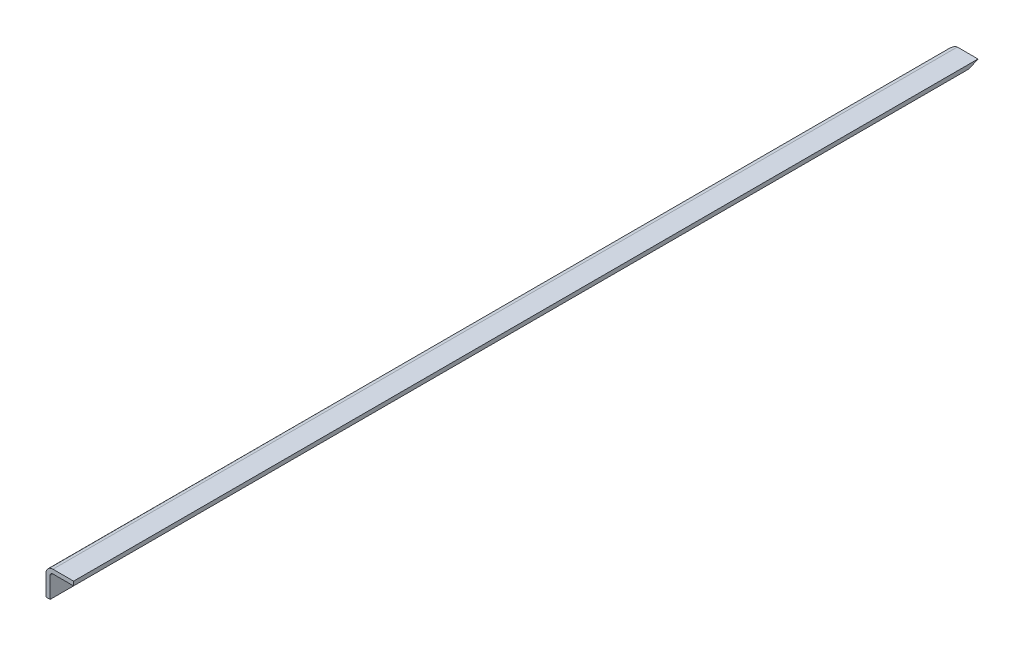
from build123d import *

# Parameters (mm, degrees)
EXTRUSION1_DEPTH        = 2750
ENL_V_MAT_EXTRU_2_DEPTH = 80


with BuildPart() as part:
    # Esquisse1 → Extrusion1 (new body)
    with BuildSketch(Plane.XY):
        with BuildLine():
            Line((0, 0), (0, 60))
            ThreePointArc((0, 60), (5.857864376, 74.142135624), (20, 80))
            Line((20, 80), (80, 80))
            Line((80, 80), (80, 68))
            Line((80, 68), (20, 68))
            ThreePointArc((20, 68), (14.343145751, 65.656854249), (12, 60))
            Line((12, 60), (12, 0))
            Line((12, 0), (0, 0))
        make_face()
    extrude(amount=EXTRUSION1_DEPTH)

    # Esquisse3 → Enl_v. mat.-Extru.2 (cut)
    with BuildSketch(Plane(origin=(80, 0, 0), x_dir=(0, 0, -1), z_dir=(1, 0, 0))):
        Polygon((0, 0), (0, 140), (-300, 0), align=None)
    extrude(amount=-ENL_V_MAT_EXTRU_2_DEPTH, mode=Mode.SUBTRACT)


solid = part.part
